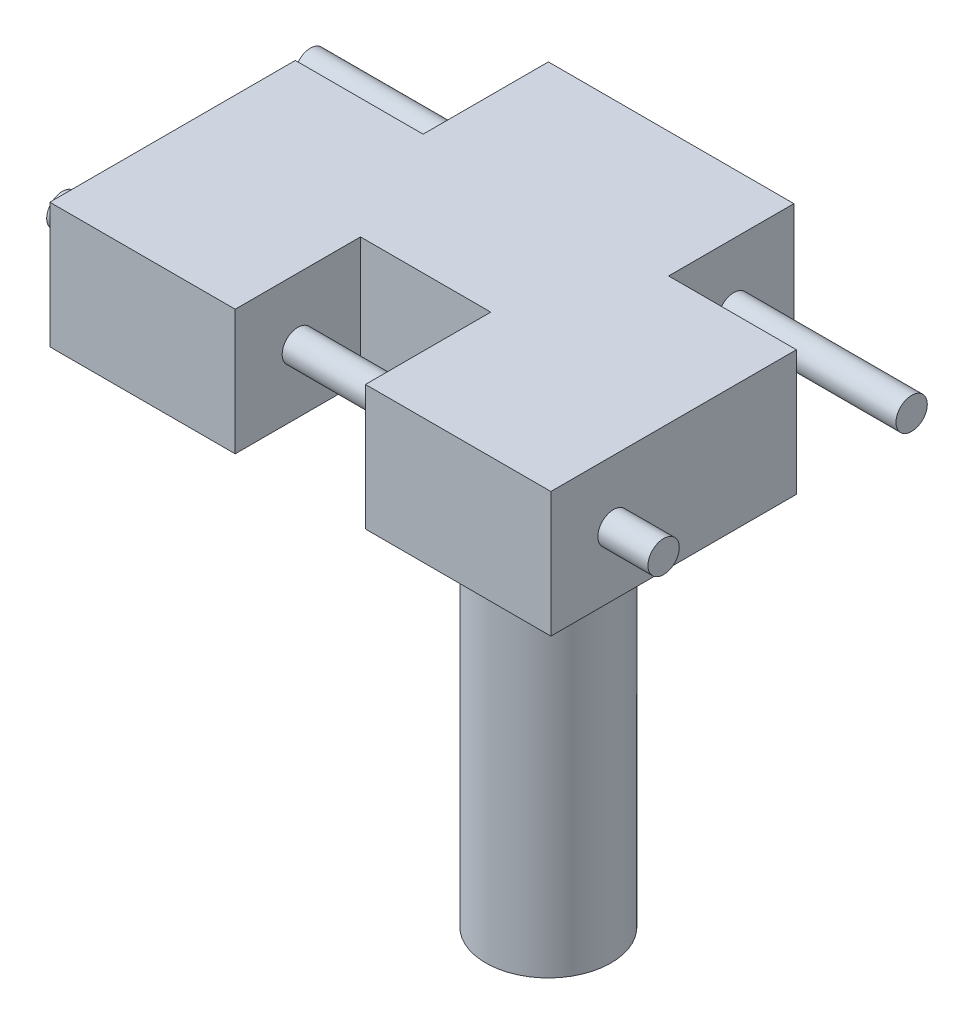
ISO-10303-21;
HEADER;
FILE_DESCRIPTION(('STEP AP214'),'2;1');
FILE_NAME('part.step','',(''),(''),'','','');
FILE_SCHEMA(('AUTOMOTIVE_DESIGN { 1 0 10303 214 1 1 1 1 }'));
ENDSEC;
DATA;
#1=APPLICATION_CONTEXT('core data for automotive mechanical design processes');
#2=APPLICATION_PROTOCOL_DEFINITION('international standard','automotive_design',2000,#1);
#3=PRODUCT_CONTEXT('',#1,'mechanical');
#4=PRODUCT('Part','Part','',(#3));
#5=PRODUCT_RELATED_PRODUCT_CATEGORY('part','',(#4));
#6=PRODUCT_DEFINITION_FORMATION('','',#4);
#7=PRODUCT_DEFINITION_CONTEXT('part definition',#1,'design');
#8=PRODUCT_DEFINITION('design','',#6,#7);
#9=PRODUCT_DEFINITION_SHAPE('','',#8);
#10=(LENGTH_UNIT() NAMED_UNIT(*) SI_UNIT(.MILLI.,.METRE.));
#11=(NAMED_UNIT(*) PLANE_ANGLE_UNIT() SI_UNIT($,.RADIAN.));
#12=(NAMED_UNIT(*) SI_UNIT($,.STERADIAN.) SOLID_ANGLE_UNIT());
#13=UNCERTAINTY_MEASURE_WITH_UNIT(LENGTH_MEASURE(1.E-05),#10,'distance_accuracy_value','');
#14=(GEOMETRIC_REPRESENTATION_CONTEXT(3) GLOBAL_UNCERTAINTY_ASSIGNED_CONTEXT((#13)) GLOBAL_UNIT_ASSIGNED_CONTEXT((#10,
#11,#12)) REPRESENTATION_CONTEXT('',''));
#15=CARTESIAN_POINT('',(0.,0.,0.));
#16=DIRECTION('',(0.,0.,1.));
#17=DIRECTION('',(1.,0.,0.));
#18=AXIS2_PLACEMENT_3D('',#15,#16,#17);
#19=CARTESIAN_POINT('',(-6.223,6.35,0.127));
#20=DIRECTION('',(1.,0.,0.));
#21=DIRECTION('',(0.,0.,-1.));
#22=AXIS2_PLACEMENT_3D('',#19,#20,#21);
#23=PLANE('',#22);
#24=CARTESIAN_POINT('',(-6.223,3.175,-3.175));
#25=DIRECTION('',(1.,0.,0.));
#26=DIRECTION('',(0.,0.,-1.));
#27=AXIS2_PLACEMENT_3D('',#24,#25,#26);
#28=CIRCLE('',#27,0.79375);
#29=CARTESIAN_POINT('',(-6.223,3.175,-3.96875));
#30=VERTEX_POINT('',#29);
#31=EDGE_CURVE('E221',#30,#30,#28,.T.);
#32=ORIENTED_EDGE('',*,*,#31,.T.);
#33=EDGE_LOOP('',(#32));
#34=FACE_BOUND('',#33,.T.);
#35=DIRECTION('',(0.,0.,1.));
#36=VECTOR('',#35,1.);
#37=CARTESIAN_POINT('',(-6.223,0.,0.127));
#38=LINE('',#37,#36);
#39=CARTESIAN_POINT('',(-6.223,0.,-6.223));
#40=VERTEX_POINT('',#39);
#41=CARTESIAN_POINT('',(-6.223,0.,0.127));
#42=VERTEX_POINT('',#41);
#43=EDGE_CURVE('E158',#40,#42,#38,.T.);
#44=ORIENTED_EDGE('',*,*,#43,.T.);
#45=DIRECTION('',(0.,-1.,0.));
#46=VECTOR('',#45,1.);
#47=CARTESIAN_POINT('',(-6.223,6.35,0.127));
#48=LINE('',#47,#46);
#49=CARTESIAN_POINT('',(-6.223,6.35,0.127));
#50=VERTEX_POINT('',#49);
#51=EDGE_CURVE('E44',#50,#42,#48,.T.);
#52=ORIENTED_EDGE('',*,*,#51,.F.);
#53=DIRECTION('',(0.,0.,1.));
#54=VECTOR('',#53,1.);
#55=CARTESIAN_POINT('',(-6.223,6.35,0.127));
#56=LINE('',#55,#54);
#57=CARTESIAN_POINT('',(-6.223,6.35,-6.223));
#58=VERTEX_POINT('',#57);
#59=EDGE_CURVE('E181',#58,#50,#56,.T.);
#60=ORIENTED_EDGE('',*,*,#59,.F.);
#61=DIRECTION('',(0.,-1.,0.));
#62=VECTOR('',#61,1.);
#63=CARTESIAN_POINT('',(-6.223,6.35,-6.223));
#64=LINE('',#63,#62);
#65=EDGE_CURVE('E154',#58,#40,#64,.T.);
#66=ORIENTED_EDGE('',*,*,#65,.T.);
#67=EDGE_LOOP('',(#44,#52,#60,#66));
#68=FACE_BOUND('',#67,.T.);
#69=ADVANCED_FACE('F35',(#34,#68),#23,.F.);
#70=CARTESIAN_POINT('',(-12.7,6.35,0.127));
#71=DIRECTION('',(0.,0.,1.));
#72=DIRECTION('',(1.,0.,0.));
#73=AXIS2_PLACEMENT_3D('',#70,#71,#72);
#74=PLANE('',#73);
#75=DIRECTION('',(-1.,0.,0.));
#76=VECTOR('',#75,1.);
#77=CARTESIAN_POINT('',(-12.7,0.,0.127));
#78=LINE('',#77,#76);
#79=CARTESIAN_POINT('',(-12.7,0.,0.127));
#80=VERTEX_POINT('',#79);
#81=EDGE_CURVE('E161',#42,#80,#78,.T.);
#82=ORIENTED_EDGE('',*,*,#81,.T.);
#83=DIRECTION('',(0.,-1.,0.));
#84=VECTOR('',#83,1.);
#85=CARTESIAN_POINT('',(-12.7,6.35,0.127));
#86=LINE('',#85,#84);
#87=CARTESIAN_POINT('',(-12.7,6.35,0.127));
#88=VERTEX_POINT('',#87);
#89=EDGE_CURVE('E203',#88,#80,#86,.T.);
#90=ORIENTED_EDGE('',*,*,#89,.F.);
#91=DIRECTION('',(-1.,0.,0.));
#92=VECTOR('',#91,1.);
#93=CARTESIAN_POINT('',(-12.7,6.35,0.127));
#94=LINE('',#93,#92);
#95=EDGE_CURVE('E109',#50,#88,#94,.T.);
#96=ORIENTED_EDGE('',*,*,#95,.F.);
#97=ORIENTED_EDGE('',*,*,#51,.T.);
#98=EDGE_LOOP('',(#82,#90,#96,#97));
#99=FACE_BOUND('',#98,.T.);
#100=ADVANCED_FACE('F271',(#99),#74,.F.);
#101=CARTESIAN_POINT('',(-12.7,6.35,12.573));
#102=DIRECTION('',(1.,0.,0.));
#103=DIRECTION('',(0.,0.,-1.));
#104=AXIS2_PLACEMENT_3D('',#101,#102,#103);
#105=PLANE('',#104);
#106=CARTESIAN_POINT('',(-12.7,3.175,9.39800000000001));
#107=DIRECTION('',(1.,0.,0.));
#108=DIRECTION('',(0.,0.,-1.));
#109=AXIS2_PLACEMENT_3D('',#106,#107,#108);
#110=CIRCLE('',#109,0.793749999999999);
#111=CARTESIAN_POINT('',(-12.7,3.175,8.60425000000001));
#112=VERTEX_POINT('',#111);
#113=EDGE_CURVE('E162',#112,#112,#110,.T.);
#114=ORIENTED_EDGE('',*,*,#113,.T.);
#115=EDGE_LOOP('',(#114));
#116=FACE_BOUND('',#115,.T.);
#117=DIRECTION('',(0.,0.,1.));
#118=VECTOR('',#117,1.);
#119=CARTESIAN_POINT('',(-12.7,0.,12.573));
#120=LINE('',#119,#118);
#121=CARTESIAN_POINT('',(-12.7,0.,12.573));
#122=VERTEX_POINT('',#121);
#123=EDGE_CURVE('E164',#80,#122,#120,.T.);
#124=ORIENTED_EDGE('',*,*,#123,.T.);
#125=DIRECTION('',(0.,-1.,0.));
#126=VECTOR('',#125,1.);
#127=CARTESIAN_POINT('',(-12.7,6.35,12.573));
#128=LINE('',#127,#126);
#129=CARTESIAN_POINT('',(-12.7,6.35,12.573));
#130=VERTEX_POINT('',#129);
#131=EDGE_CURVE('E200',#130,#122,#128,.T.);
#132=ORIENTED_EDGE('',*,*,#131,.F.);
#133=DIRECTION('',(0.,0.,1.));
#134=VECTOR('',#133,1.);
#135=CARTESIAN_POINT('',(-12.7,6.35,12.573));
#136=LINE('',#135,#134);
#137=EDGE_CURVE('E231',#88,#130,#136,.T.);
#138=ORIENTED_EDGE('',*,*,#137,.F.);
#139=ORIENTED_EDGE('',*,*,#89,.T.);
#140=EDGE_LOOP('',(#124,#132,#138,#139));
#141=FACE_BOUND('',#140,.T.);
#142=ADVANCED_FACE('F276',(#116,#141),#105,.F.);
#143=CARTESIAN_POINT('',(-3.302,6.35,12.573));
#144=DIRECTION('',(0.,0.,-1.));
#145=DIRECTION('',(-1.,0.,0.));
#146=AXIS2_PLACEMENT_3D('',#143,#144,#145);
#147=PLANE('',#146);
#148=DIRECTION('',(1.,0.,0.));
#149=VECTOR('',#148,1.);
#150=CARTESIAN_POINT('',(-3.302,0.,12.573));
#151=LINE('',#150,#149);
#152=CARTESIAN_POINT('',(-3.302,0.,12.573));
#153=VERTEX_POINT('',#152);
#154=EDGE_CURVE('E166',#122,#153,#151,.T.);
#155=ORIENTED_EDGE('',*,*,#154,.T.);
#156=DIRECTION('',(0.,-1.,0.));
#157=VECTOR('',#156,1.);
#158=CARTESIAN_POINT('',(-3.302,6.35,12.573));
#159=LINE('',#158,#157);
#160=CARTESIAN_POINT('',(-3.302,6.35,12.573));
#161=VERTEX_POINT('',#160);
#162=EDGE_CURVE('E197',#161,#153,#159,.T.);
#163=ORIENTED_EDGE('',*,*,#162,.F.);
#164=DIRECTION('',(1.,0.,0.));
#165=VECTOR('',#164,1.);
#166=CARTESIAN_POINT('',(-3.302,6.35,12.573));
#167=LINE('',#166,#165);
#168=EDGE_CURVE('E233',#130,#161,#167,.T.);
#169=ORIENTED_EDGE('',*,*,#168,.F.);
#170=ORIENTED_EDGE('',*,*,#131,.T.);
#171=EDGE_LOOP('',(#155,#163,#169,#170));
#172=FACE_BOUND('',#171,.T.);
#173=ADVANCED_FACE('F422',(#172),#147,.F.);
#174=CARTESIAN_POINT('',(-3.302,6.35,6.223));
#175=DIRECTION('',(-1.,0.,0.));
#176=DIRECTION('',(0.,0.,1.));
#177=AXIS2_PLACEMENT_3D('',#174,#175,#176);
#178=PLANE('',#177);
#179=CARTESIAN_POINT('',(-3.302,3.175,9.398));
#180=DIRECTION('',(-1.,0.,0.));
#181=DIRECTION('',(0.,0.,1.));
#182=AXIS2_PLACEMENT_3D('',#179,#180,#181);
#183=CIRCLE('',#182,0.793749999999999);
#184=CARTESIAN_POINT('',(-3.302,3.175,10.19175));
#185=VERTEX_POINT('',#184);
#186=EDGE_CURVE('E213',#185,#185,#183,.T.);
#187=ORIENTED_EDGE('',*,*,#186,.T.);
#188=EDGE_LOOP('',(#187));
#189=FACE_BOUND('',#188,.T.);
#190=DIRECTION('',(0.,0.,-1.));
#191=VECTOR('',#190,1.);
#192=CARTESIAN_POINT('',(-3.302,0.,6.223));
#193=LINE('',#192,#191);
#194=CARTESIAN_POINT('',(-3.302,0.,6.223));
#195=VERTEX_POINT('',#194);
#196=EDGE_CURVE('E168',#153,#195,#193,.T.);
#197=ORIENTED_EDGE('',*,*,#196,.T.);
#198=DIRECTION('',(0.,-1.,0.));
#199=VECTOR('',#198,1.);
#200=CARTESIAN_POINT('',(-3.302,6.35,6.223));
#201=LINE('',#200,#199);
#202=CARTESIAN_POINT('',(-3.302,6.35,6.223));
#203=VERTEX_POINT('',#202);
#204=EDGE_CURVE('E194',#203,#195,#201,.T.);
#205=ORIENTED_EDGE('',*,*,#204,.F.);
#206=DIRECTION('',(0.,0.,-1.));
#207=VECTOR('',#206,1.);
#208=CARTESIAN_POINT('',(-3.302,6.35,6.223));
#209=LINE('',#208,#207);
#210=EDGE_CURVE('E235',#161,#203,#209,.T.);
#211=ORIENTED_EDGE('',*,*,#210,.F.);
#212=ORIENTED_EDGE('',*,*,#162,.T.);
#213=EDGE_LOOP('',(#197,#205,#211,#212));
#214=FACE_BOUND('',#213,.T.);
#215=ADVANCED_FACE('F417',(#189,#214),#178,.F.);
#216=CARTESIAN_POINT('',(3.302,6.35,6.223));
#217=DIRECTION('',(0.,0.,-1.));
#218=DIRECTION('',(-1.,0.,0.));
#219=AXIS2_PLACEMENT_3D('',#216,#217,#218);
#220=PLANE('',#219);
#221=DIRECTION('',(1.,0.,0.));
#222=VECTOR('',#221,1.);
#223=CARTESIAN_POINT('',(3.302,0.,6.223));
#224=LINE('',#223,#222);
#225=CARTESIAN_POINT('',(3.302,0.,6.223));
#226=VERTEX_POINT('',#225);
#227=EDGE_CURVE('E170',#195,#226,#224,.T.);
#228=ORIENTED_EDGE('',*,*,#227,.T.);
#229=DIRECTION('',(0.,-1.,0.));
#230=VECTOR('',#229,1.);
#231=CARTESIAN_POINT('',(3.302,6.35,6.223));
#232=LINE('',#231,#230);
#233=CARTESIAN_POINT('',(3.302,6.35,6.223));
#234=VERTEX_POINT('',#233);
#235=EDGE_CURVE('E191',#234,#226,#232,.T.);
#236=ORIENTED_EDGE('',*,*,#235,.F.);
#237=DIRECTION('',(1.,0.,0.));
#238=VECTOR('',#237,1.);
#239=CARTESIAN_POINT('',(3.302,6.35,6.223));
#240=LINE('',#239,#238);
#241=EDGE_CURVE('E237',#203,#234,#240,.T.);
#242=ORIENTED_EDGE('',*,*,#241,.F.);
#243=ORIENTED_EDGE('',*,*,#204,.T.);
#244=EDGE_LOOP('',(#228,#236,#242,#243));
#245=FACE_BOUND('',#244,.T.);
#246=ADVANCED_FACE('F409',(#245),#220,.F.);
#247=CARTESIAN_POINT('',(3.302,6.35,12.573));
#248=DIRECTION('',(1.,0.,0.));
#249=DIRECTION('',(0.,0.,-1.));
#250=AXIS2_PLACEMENT_3D('',#247,#248,#249);
#251=PLANE('',#250);
#252=CARTESIAN_POINT('',(3.302,3.175,9.398));
#253=DIRECTION('',(1.,0.,0.));
#254=DIRECTION('',(0.,0.,-1.));
#255=AXIS2_PLACEMENT_3D('',#252,#253,#254);
#256=CIRCLE('',#255,0.793749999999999);
#257=CARTESIAN_POINT('',(3.302,3.175,8.60425));
#258=VERTEX_POINT('',#257);
#259=EDGE_CURVE('E208',#258,#258,#256,.T.);
#260=ORIENTED_EDGE('',*,*,#259,.T.);
#261=EDGE_LOOP('',(#260));
#262=FACE_BOUND('',#261,.T.);
#263=DIRECTION('',(0.,0.,1.));
#264=VECTOR('',#263,1.);
#265=CARTESIAN_POINT('',(3.302,0.,12.573));
#266=LINE('',#265,#264);
#267=CARTESIAN_POINT('',(3.302,0.,12.573));
#268=VERTEX_POINT('',#267);
#269=EDGE_CURVE('E172',#226,#268,#266,.T.);
#270=ORIENTED_EDGE('',*,*,#269,.T.);
#271=DIRECTION('',(0.,-1.,0.));
#272=VECTOR('',#271,1.);
#273=CARTESIAN_POINT('',(3.302,6.35,12.573));
#274=LINE('',#273,#272);
#275=CARTESIAN_POINT('',(3.302,6.35,12.573));
#276=VERTEX_POINT('',#275);
#277=EDGE_CURVE('E188',#276,#268,#274,.T.);
#278=ORIENTED_EDGE('',*,*,#277,.F.);
#279=DIRECTION('',(0.,0.,1.));
#280=VECTOR('',#279,1.);
#281=CARTESIAN_POINT('',(3.302,6.35,12.573));
#282=LINE('',#281,#280);
#283=EDGE_CURVE('E239',#234,#276,#282,.T.);
#284=ORIENTED_EDGE('',*,*,#283,.F.);
#285=ORIENTED_EDGE('',*,*,#235,.T.);
#286=EDGE_LOOP('',(#270,#278,#284,#285));
#287=FACE_BOUND('',#286,.T.);
#288=ADVANCED_FACE('F404',(#262,#287),#251,.F.);
#289=CARTESIAN_POINT('',(12.7,6.35,12.573));
#290=DIRECTION('',(0.,0.,-1.));
#291=DIRECTION('',(-1.,0.,0.));
#292=AXIS2_PLACEMENT_3D('',#289,#290,#291);
#293=PLANE('',#292);
#294=DIRECTION('',(1.,0.,0.));
#295=VECTOR('',#294,1.);
#296=CARTESIAN_POINT('',(12.7,0.,12.573));
#297=LINE('',#296,#295);
#298=CARTESIAN_POINT('',(12.7,0.,12.573));
#299=VERTEX_POINT('',#298);
#300=EDGE_CURVE('E174',#268,#299,#297,.T.);
#301=ORIENTED_EDGE('',*,*,#300,.T.);
#302=DIRECTION('',(0.,-1.,0.));
#303=VECTOR('',#302,1.);
#304=CARTESIAN_POINT('',(12.7,6.35,12.573));
#305=LINE('',#304,#303);
#306=CARTESIAN_POINT('',(12.7,6.35,12.573));
#307=VERTEX_POINT('',#306);
#308=EDGE_CURVE('E185',#307,#299,#305,.T.);
#309=ORIENTED_EDGE('',*,*,#308,.F.);
#310=DIRECTION('',(1.,0.,0.));
#311=VECTOR('',#310,1.);
#312=CARTESIAN_POINT('',(12.7,6.35,12.573));
#313=LINE('',#312,#311);
#314=EDGE_CURVE('E241',#276,#307,#313,.T.);
#315=ORIENTED_EDGE('',*,*,#314,.F.);
#316=ORIENTED_EDGE('',*,*,#277,.T.);
#317=EDGE_LOOP('',(#301,#309,#315,#316));
#318=FACE_BOUND('',#317,.T.);
#319=ADVANCED_FACE('F247',(#318),#293,.F.);
#320=CARTESIAN_POINT('',(12.7,6.35,0.127));
#321=DIRECTION('',(-1.,0.,0.));
#322=DIRECTION('',(0.,0.,1.));
#323=AXIS2_PLACEMENT_3D('',#320,#321,#322);
#324=PLANE('',#323);
#325=CARTESIAN_POINT('',(12.7,3.175,9.398));
#326=DIRECTION('',(-1.,0.,0.));
#327=DIRECTION('',(0.,0.,1.));
#328=AXIS2_PLACEMENT_3D('',#325,#326,#327);
#329=CIRCLE('',#328,0.793749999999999);
#330=CARTESIAN_POINT('',(12.7,3.175,10.19175));
#331=VERTEX_POINT('',#330);
#332=EDGE_CURVE('E206',#331,#331,#329,.T.);
#333=ORIENTED_EDGE('',*,*,#332,.T.);
#334=EDGE_LOOP('',(#333));
#335=FACE_BOUND('',#334,.T.);
#336=DIRECTION('',(0.,0.,-1.));
#337=VECTOR('',#336,1.);
#338=CARTESIAN_POINT('',(12.7,0.,0.127));
#339=LINE('',#338,#337);
#340=CARTESIAN_POINT('',(12.7,0.,0.127));
#341=VERTEX_POINT('',#340);
#342=EDGE_CURVE('E176',#299,#341,#339,.T.);
#343=ORIENTED_EDGE('',*,*,#342,.T.);
#344=DIRECTION('',(0.,-1.,0.));
#345=VECTOR('',#344,1.);
#346=CARTESIAN_POINT('',(12.7,6.35,0.127));
#347=LINE('',#346,#345);
#348=CARTESIAN_POINT('',(12.7,6.35,0.127));
#349=VERTEX_POINT('',#348);
#350=EDGE_CURVE('E149',#349,#341,#347,.T.);
#351=ORIENTED_EDGE('',*,*,#350,.F.);
#352=DIRECTION('',(0.,0.,-1.));
#353=VECTOR('',#352,1.);
#354=CARTESIAN_POINT('',(12.7,6.35,0.127));
#355=LINE('',#354,#353);
#356=EDGE_CURVE('E140',#307,#349,#355,.T.);
#357=ORIENTED_EDGE('',*,*,#356,.F.);
#358=ORIENTED_EDGE('',*,*,#308,.T.);
#359=EDGE_LOOP('',(#343,#351,#357,#358));
#360=FACE_BOUND('',#359,.T.);
#361=ADVANCED_FACE('F251',(#335,#360),#324,.F.);
#362=CARTESIAN_POINT('',(6.223,6.35,0.127));
#363=DIRECTION('',(0.,0.,1.));
#364=DIRECTION('',(1.,0.,0.));
#365=AXIS2_PLACEMENT_3D('',#362,#363,#364);
#366=PLANE('',#365);
#367=DIRECTION('',(-1.,0.,0.));
#368=VECTOR('',#367,1.);
#369=CARTESIAN_POINT('',(6.223,0.,0.127));
#370=LINE('',#369,#368);
#371=CARTESIAN_POINT('',(6.223,0.,0.127));
#372=VERTEX_POINT('',#371);
#373=EDGE_CURVE('E148',#341,#372,#370,.T.);
#374=ORIENTED_EDGE('',*,*,#373,.T.);
#375=DIRECTION('',(0.,-1.,0.));
#376=VECTOR('',#375,1.);
#377=CARTESIAN_POINT('',(6.223,6.35,0.127));
#378=LINE('',#377,#376);
#379=CARTESIAN_POINT('',(6.223,6.35,0.127));
#380=VERTEX_POINT('',#379);
#381=EDGE_CURVE('E145',#380,#372,#378,.T.);
#382=ORIENTED_EDGE('',*,*,#381,.F.);
#383=DIRECTION('',(-1.,0.,0.));
#384=VECTOR('',#383,1.);
#385=CARTESIAN_POINT('',(6.223,6.35,0.127));
#386=LINE('',#385,#384);
#387=EDGE_CURVE('E134',#349,#380,#386,.T.);
#388=ORIENTED_EDGE('',*,*,#387,.F.);
#389=ORIENTED_EDGE('',*,*,#350,.T.);
#390=EDGE_LOOP('',(#374,#382,#388,#389));
#391=FACE_BOUND('',#390,.T.);
#392=ADVANCED_FACE('F146',(#391),#366,.F.);
#393=CARTESIAN_POINT('',(6.223,6.35,-6.223));
#394=DIRECTION('',(-1.,0.,0.));
#395=DIRECTION('',(0.,0.,1.));
#396=AXIS2_PLACEMENT_3D('',#393,#394,#395);
#397=PLANE('',#396);
#398=CARTESIAN_POINT('',(6.223,3.175,-3.175));
#399=DIRECTION('',(-1.,0.,0.));
#400=DIRECTION('',(0.,0.,1.));
#401=AXIS2_PLACEMENT_3D('',#398,#399,#400);
#402=CIRCLE('',#401,0.79375);
#403=CARTESIAN_POINT('',(6.223,3.175,-2.38125));
#404=VERTEX_POINT('',#403);
#405=EDGE_CURVE('E38',#404,#404,#402,.T.);
#406=ORIENTED_EDGE('',*,*,#405,.T.);
#407=EDGE_LOOP('',(#406));
#408=FACE_BOUND('',#407,.T.);
#409=DIRECTION('',(0.,0.,-1.));
#410=VECTOR('',#409,1.);
#411=CARTESIAN_POINT('',(6.223,0.,-6.223));
#412=LINE('',#411,#410);
#413=CARTESIAN_POINT('',(6.223,0.,-6.223));
#414=VERTEX_POINT('',#413);
#415=EDGE_CURVE('E94',#372,#414,#412,.T.);
#416=ORIENTED_EDGE('',*,*,#415,.T.);
#417=DIRECTION('',(0.,-1.,0.));
#418=VECTOR('',#417,1.);
#419=CARTESIAN_POINT('',(6.223,6.35,-6.223));
#420=LINE('',#419,#418);
#421=CARTESIAN_POINT('',(6.223,6.35,-6.223));
#422=VERTEX_POINT('',#421);
#423=EDGE_CURVE('E150',#422,#414,#420,.T.);
#424=ORIENTED_EDGE('',*,*,#423,.F.);
#425=DIRECTION('',(0.,0.,-1.));
#426=VECTOR('',#425,1.);
#427=CARTESIAN_POINT('',(6.223,6.35,-6.223));
#428=LINE('',#427,#426);
#429=EDGE_CURVE('E138',#380,#422,#428,.T.);
#430=ORIENTED_EDGE('',*,*,#429,.F.);
#431=ORIENTED_EDGE('',*,*,#381,.T.);
#432=EDGE_LOOP('',(#416,#424,#430,#431));
#433=FACE_BOUND('',#432,.T.);
#434=ADVANCED_FACE('F152',(#408,#433),#397,.F.);
#435=CARTESIAN_POINT('',(-6.223,6.35,-6.223));
#436=DIRECTION('',(0.,0.,1.));
#437=DIRECTION('',(1.,0.,0.));
#438=AXIS2_PLACEMENT_3D('',#435,#436,#437);
#439=PLANE('',#438);
#440=DIRECTION('',(-1.,0.,0.));
#441=VECTOR('',#440,1.);
#442=CARTESIAN_POINT('',(-6.223,0.,-6.223));
#443=LINE('',#442,#441);
#444=EDGE_CURVE('E100',#414,#40,#443,.T.);
#445=ORIENTED_EDGE('',*,*,#444,.T.);
#446=ORIENTED_EDGE('',*,*,#65,.F.);
#447=DIRECTION('',(-1.,0.,0.));
#448=VECTOR('',#447,1.);
#449=CARTESIAN_POINT('',(-6.223,6.35,-6.223));
#450=LINE('',#449,#448);
#451=EDGE_CURVE('E53',#422,#58,#450,.T.);
#452=ORIENTED_EDGE('',*,*,#451,.F.);
#453=ORIENTED_EDGE('',*,*,#423,.T.);
#454=EDGE_LOOP('',(#445,#446,#452,#453));
#455=FACE_BOUND('',#454,.T.);
#456=ADVANCED_FACE('F259',(#455),#439,.F.);
#457=CARTESIAN_POINT('',(0.,6.35,0.));
#458=DIRECTION('',(0.,-1.,0.));
#459=DIRECTION('',(0.,0.,-1.));
#460=AXIS2_PLACEMENT_3D('',#457,#458,#459);
#461=PLANE('',#460);
#462=ORIENTED_EDGE('',*,*,#59,.T.);
#463=ORIENTED_EDGE('',*,*,#95,.T.);
#464=ORIENTED_EDGE('',*,*,#137,.T.);
#465=ORIENTED_EDGE('',*,*,#168,.T.);
#466=ORIENTED_EDGE('',*,*,#210,.T.);
#467=ORIENTED_EDGE('',*,*,#241,.T.);
#468=ORIENTED_EDGE('',*,*,#283,.T.);
#469=ORIENTED_EDGE('',*,*,#314,.T.);
#470=ORIENTED_EDGE('',*,*,#356,.T.);
#471=ORIENTED_EDGE('',*,*,#387,.T.);
#472=ORIENTED_EDGE('',*,*,#429,.T.);
#473=ORIENTED_EDGE('',*,*,#451,.T.);
#474=EDGE_LOOP('',(#462,#463,#464,#465,#466,#467,#468,#469,#470,#471,#472,#473));
#475=FACE_BOUND('',#474,.T.);
#476=ADVANCED_FACE('F136',(#475),#461,.F.);
#477=CARTESIAN_POINT('',(0.,0.,0.));
#478=DIRECTION('',(0.,-1.,0.));
#479=DIRECTION('',(0.,0.,-1.));
#480=AXIS2_PLACEMENT_3D('',#477,#478,#479);
#481=PLANE('',#480);
#482=CARTESIAN_POINT('',(0.,0.,0.));
#483=DIRECTION('',(0.,-1.,0.));
#484=DIRECTION('',(0.,0.,-1.));
#485=AXIS2_PLACEMENT_3D('',#482,#483,#484);
#486=CIRCLE('',#485,3.175);
#487=CARTESIAN_POINT('',(0.,0.,-3.175));
#488=VERTEX_POINT('',#487);
#489=EDGE_CURVE('E11',#488,#488,#486,.T.);
#490=ORIENTED_EDGE('',*,*,#489,.F.);
#491=EDGE_LOOP('',(#490));
#492=FACE_BOUND('',#491,.T.);
#493=ORIENTED_EDGE('',*,*,#43,.F.);
#494=ORIENTED_EDGE('',*,*,#444,.F.);
#495=ORIENTED_EDGE('',*,*,#415,.F.);
#496=ORIENTED_EDGE('',*,*,#373,.F.);
#497=ORIENTED_EDGE('',*,*,#342,.F.);
#498=ORIENTED_EDGE('',*,*,#300,.F.);
#499=ORIENTED_EDGE('',*,*,#269,.F.);
#500=ORIENTED_EDGE('',*,*,#227,.F.);
#501=ORIENTED_EDGE('',*,*,#196,.F.);
#502=ORIENTED_EDGE('',*,*,#154,.F.);
#503=ORIENTED_EDGE('',*,*,#123,.F.);
#504=ORIENTED_EDGE('',*,*,#81,.F.);
#505=EDGE_LOOP('',(#493,#494,#495,#496,#497,#498,#499,#500,#501,#502,#503,#504));
#506=FACE_BOUND('',#505,.T.);
#507=ADVANCED_FACE('F254',(#492,#506),#481,.T.);
#508=CARTESIAN_POINT('',(15.24,3.175,9.398));
#509=DIRECTION('',(1.,0.,0.));
#510=DIRECTION('',(0.,0.,-1.));
#511=AXIS2_PLACEMENT_3D('',#508,#509,#510);
#512=PLANE('',#511);
#513=CARTESIAN_POINT('',(15.24,3.175,9.398));
#514=DIRECTION('',(1.,0.,0.));
#515=DIRECTION('',(0.,0.,-1.));
#516=AXIS2_PLACEMENT_3D('',#513,#514,#515);
#517=CIRCLE('',#516,0.793749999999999);
#518=CARTESIAN_POINT('',(15.24,3.175,8.60425));
#519=VERTEX_POINT('',#518);
#520=EDGE_CURVE('E216',#519,#519,#517,.T.);
#521=ORIENTED_EDGE('',*,*,#520,.T.);
#522=EDGE_LOOP('',(#521));
#523=FACE_BOUND('',#522,.T.);
#524=ADVANCED_FACE('F302',(#523),#512,.T.);
#525=CARTESIAN_POINT('',(-15.24,3.175,9.39800000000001));
#526=DIRECTION('',(1.,0.,0.));
#527=DIRECTION('',(0.,0.,-1.));
#528=AXIS2_PLACEMENT_3D('',#525,#526,#527);
#529=CYLINDRICAL_SURFACE('',#528,0.793749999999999);
#530=ORIENTED_EDGE('',*,*,#520,.F.);
#531=EDGE_LOOP('',(#530));
#532=FACE_BOUND('',#531,.T.);
#533=ORIENTED_EDGE('',*,*,#332,.F.);
#534=EDGE_LOOP('',(#533));
#535=FACE_BOUND('',#534,.T.);
#536=ADVANCED_FACE('F306',(#532,#535),#529,.T.);
#537=ORIENTED_EDGE('',*,*,#259,.F.);
#538=EDGE_LOOP('',(#537));
#539=FACE_BOUND('',#538,.T.);
#540=ORIENTED_EDGE('',*,*,#186,.F.);
#541=EDGE_LOOP('',(#540));
#542=FACE_BOUND('',#541,.T.);
#543=ADVANCED_FACE('F314',(#539,#542),#529,.T.);
#544=CARTESIAN_POINT('',(-15.24,3.175,9.39800000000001));
#545=DIRECTION('',(1.,0.,0.));
#546=DIRECTION('',(0.,0.,-1.));
#547=AXIS2_PLACEMENT_3D('',#544,#545,#546);
#548=CIRCLE('',#547,0.793749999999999);
#549=CARTESIAN_POINT('',(-15.24,3.175,8.60425000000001));
#550=VERTEX_POINT('',#549);
#551=EDGE_CURVE('E209',#550,#550,#548,.T.);
#552=ORIENTED_EDGE('',*,*,#551,.T.);
#553=EDGE_LOOP('',(#552));
#554=FACE_BOUND('',#553,.T.);
#555=ORIENTED_EDGE('',*,*,#113,.F.);
#556=EDGE_LOOP('',(#555));
#557=FACE_BOUND('',#556,.T.);
#558=ADVANCED_FACE('F310',(#554,#557),#529,.T.);
#559=CARTESIAN_POINT('',(-15.24,3.175,9.39800000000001));
#560=DIRECTION('',(1.,0.,0.));
#561=DIRECTION('',(0.,0.,-1.));
#562=AXIS2_PLACEMENT_3D('',#559,#560,#561);
#563=PLANE('',#562);
#564=ORIENTED_EDGE('',*,*,#551,.F.);
#565=EDGE_LOOP('',(#564));
#566=FACE_BOUND('',#565,.T.);
#567=ADVANCED_FACE('F313',(#566),#563,.F.);
#568=CARTESIAN_POINT('',(15.24,3.175,-3.175));
#569=DIRECTION('',(1.,0.,0.));
#570=DIRECTION('',(0.,0.,-1.));
#571=AXIS2_PLACEMENT_3D('',#568,#569,#570);
#572=PLANE('',#571);
#573=CARTESIAN_POINT('',(15.24,3.175,-3.175));
#574=DIRECTION('',(1.,0.,0.));
#575=DIRECTION('',(0.,0.,-1.));
#576=AXIS2_PLACEMENT_3D('',#573,#574,#575);
#577=CIRCLE('',#576,0.79375);
#578=CARTESIAN_POINT('',(15.24,3.175,-3.96875));
#579=VERTEX_POINT('',#578);
#580=EDGE_CURVE('E285',#579,#579,#577,.T.);
#581=ORIENTED_EDGE('',*,*,#580,.T.);
#582=EDGE_LOOP('',(#581));
#583=FACE_BOUND('',#582,.T.);
#584=ADVANCED_FACE('F316',(#583),#572,.T.);
#585=CARTESIAN_POINT('',(-15.24,3.175,-3.17499999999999));
#586=DIRECTION('',(1.,0.,0.));
#587=DIRECTION('',(0.,0.,-1.));
#588=AXIS2_PLACEMENT_3D('',#585,#586,#587);
#589=CYLINDRICAL_SURFACE('',#588,0.79375);
#590=ORIENTED_EDGE('',*,*,#580,.F.);
#591=EDGE_LOOP('',(#590));
#592=FACE_BOUND('',#591,.T.);
#593=ORIENTED_EDGE('',*,*,#405,.F.);
#594=EDGE_LOOP('',(#593));
#595=FACE_BOUND('',#594,.T.);
#596=ADVANCED_FACE('F322',(#592,#595),#589,.T.);
#597=CARTESIAN_POINT('',(-15.24,3.175,-3.17499999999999));
#598=DIRECTION('',(1.,0.,0.));
#599=DIRECTION('',(0.,0.,-1.));
#600=AXIS2_PLACEMENT_3D('',#597,#598,#599);
#601=CIRCLE('',#600,0.79375);
#602=CARTESIAN_POINT('',(-15.24,3.175,-3.96874999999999));
#603=VERTEX_POINT('',#602);
#604=EDGE_CURVE('E281',#603,#603,#601,.T.);
#605=ORIENTED_EDGE('',*,*,#604,.T.);
#606=EDGE_LOOP('',(#605));
#607=FACE_BOUND('',#606,.T.);
#608=ORIENTED_EDGE('',*,*,#31,.F.);
#609=EDGE_LOOP('',(#608));
#610=FACE_BOUND('',#609,.T.);
#611=ADVANCED_FACE('F319',(#607,#610),#589,.T.);
#612=CARTESIAN_POINT('',(-15.24,3.175,-3.17499999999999));
#613=DIRECTION('',(1.,0.,0.));
#614=DIRECTION('',(0.,0.,-1.));
#615=AXIS2_PLACEMENT_3D('',#612,#613,#614);
#616=PLANE('',#615);
#617=ORIENTED_EDGE('',*,*,#604,.F.);
#618=EDGE_LOOP('',(#617));
#619=FACE_BOUND('',#618,.T.);
#620=ADVANCED_FACE('F297',(#619),#616,.F.);
#621=CARTESIAN_POINT('',(0.,-25.4,0.));
#622=DIRECTION('',(0.,1.,0.));
#623=DIRECTION('',(0.,0.,1.));
#624=AXIS2_PLACEMENT_3D('',#621,#622,#623);
#625=CYLINDRICAL_SURFACE('',#624,3.175);
#626=CARTESIAN_POINT('',(0.,-25.4,0.));
#627=DIRECTION('',(0.,-1.,0.));
#628=DIRECTION('',(0.,0.,-1.));
#629=AXIS2_PLACEMENT_3D('',#626,#627,#628);
#630=CIRCLE('',#629,3.175);
#631=CARTESIAN_POINT('',(0.,-25.4,-3.175));
#632=VERTEX_POINT('',#631);
#633=EDGE_CURVE('E287',#632,#632,#630,.T.);
#634=ORIENTED_EDGE('',*,*,#633,.F.);
#635=EDGE_LOOP('',(#634));
#636=FACE_BOUND('',#635,.T.);
#637=ORIENTED_EDGE('',*,*,#489,.T.);
#638=EDGE_LOOP('',(#637));
#639=FACE_BOUND('',#638,.T.);
#640=ADVANCED_FACE('F294',(#636,#639),#625,.T.);
#641=CARTESIAN_POINT('',(0.,-25.4,0.));
#642=DIRECTION('',(0.,-1.,0.));
#643=DIRECTION('',(0.,0.,-1.));
#644=AXIS2_PLACEMENT_3D('',#641,#642,#643);
#645=PLANE('',#644);
#646=ORIENTED_EDGE('',*,*,#633,.T.);
#647=EDGE_LOOP('',(#646));
#648=FACE_BOUND('',#647,.T.);
#649=ADVANCED_FACE('F292',(#648),#645,.T.);
#650=CLOSED_SHELL('',(#69,#100,#142,#173,#215,#246,#288,#319,#361,#392,#434,#456,#476,#507,#524,
#536,#543,#558,#567,#584,#596,#611,#620,#640,#649));
#651=MANIFOLD_SOLID_BREP('B2',#650);
#652=ADVANCED_BREP_SHAPE_REPRESENTATION('',(#18,#651),#14);
#653=SHAPE_DEFINITION_REPRESENTATION(#9,#652);
ENDSEC;
END-ISO-10303-21;
